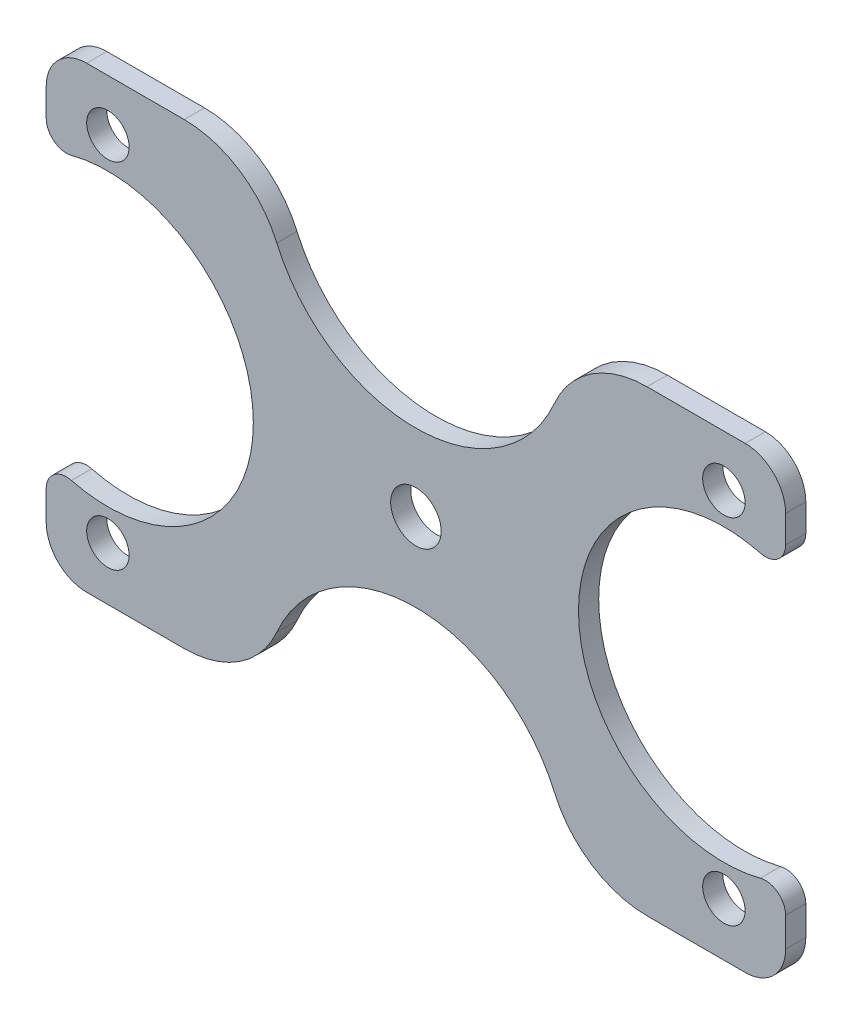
from build123d import *

# Parameters (mm, degrees)
ESQUISSE1_R        = 2.5
ESQUISSE1_R_2      = 2.1
BOSS_EXTRU_1_DEPTH = 2


with BuildPart() as part:
    # Esquisse1 → Boss.-Extru.1 (new body)
    with BuildSketch(Plane.XY):
        with BuildLine():
            Line((-36.610168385, 15.87660278), (-36.610168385, 18.596808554))
            ThreePointArc((-36.610168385, 18.596808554), (-35.43859551, 21.425235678), (-32.610168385, 22.596808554))
            Line((-32.610168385, 22.596808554), (-22.937940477, 22.596808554))
            ThreePointArc((-22.937940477, 22.596808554), (-17.460714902, 20.963408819), (-13.772789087, 16.596808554))
            ThreePointArc((-13.772789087, 16.596808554), (-0.025062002, 7.596808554), (13.722665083, 16.596808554))
            ThreePointArc((13.722665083, 16.596808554), (17.410590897, 20.963408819), (22.887816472, 22.596808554))
            Line((22.887816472, 22.596808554), (32.610168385, 22.596808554))
            ThreePointArc((32.610168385, 22.596808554), (35.43859551, 21.425235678), (36.610168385, 18.596808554))
            Line((36.610168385, 18.596808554), (36.610168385, 15.87660278))
            ThreePointArc((36.610168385, 15.87660278), (35.834406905, 14.295071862), (34.108928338, 13.94043171))
            ThreePointArc((34.108928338, 13.94043171), (16.1, 0), (34.108928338, -13.94043171))
            ThreePointArc((34.108928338, -13.94043171), (35.834406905, -14.295071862), (36.610168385, -15.87660278))
            Line((36.610168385, -15.87660278), (36.610168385, -18.777797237))
            ThreePointArc((36.610168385, -18.777797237), (35.43859551, -21.606224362), (32.610168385, -22.777797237))
            Line((32.610168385, -22.777797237), (22.887816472, -22.777797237))
            ThreePointArc((22.887816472, -22.777797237), (17.410590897, -21.144397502), (13.722665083, -16.777797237))
            ThreePointArc((13.722665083, -16.777797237), (-0.025062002, -7.777797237), (-13.772789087, -16.777797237))
            ThreePointArc((-13.772789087, -16.777797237), (-17.460714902, -21.144397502), (-22.937940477, -22.777797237))
            Line((-22.937940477, -22.777797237), (-32.610168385, -22.777797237))
            ThreePointArc((-32.610168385, -22.777797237), (-35.43859551, -21.606224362), (-36.610168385, -18.777797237))
            Line((-36.610168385, -18.777797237), (-36.610168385, -15.87660278))
            ThreePointArc((-36.610168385, -15.87660278), (-35.834406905, -14.295071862), (-34.108928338, -13.94043171))
            ThreePointArc((-34.108928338, -13.94043171), (-16.1, 0), (-34.108928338, 13.94043171))
            ThreePointArc((-34.108928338, 13.94043171), (-35.834406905, 14.295071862), (-36.610168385, 15.87660278))
        make_face()
        Circle(ESQUISSE1_R, mode=Mode.SUBTRACT)
        with Locations((-30.5, 17.5)):
            Circle(ESQUISSE1_R_2, mode=Mode.SUBTRACT)
        with Locations((-30.5, -17.5)):
            Circle(ESQUISSE1_R_2, mode=Mode.SUBTRACT)
        with Locations((30.5, -17.5)):
            Circle(ESQUISSE1_R_2, mode=Mode.SUBTRACT)
        with Locations((30.5, 17.5)):
            Circle(ESQUISSE1_R_2, mode=Mode.SUBTRACT)
    extrude(amount=BOSS_EXTRU_1_DEPTH)


solid = part.part
